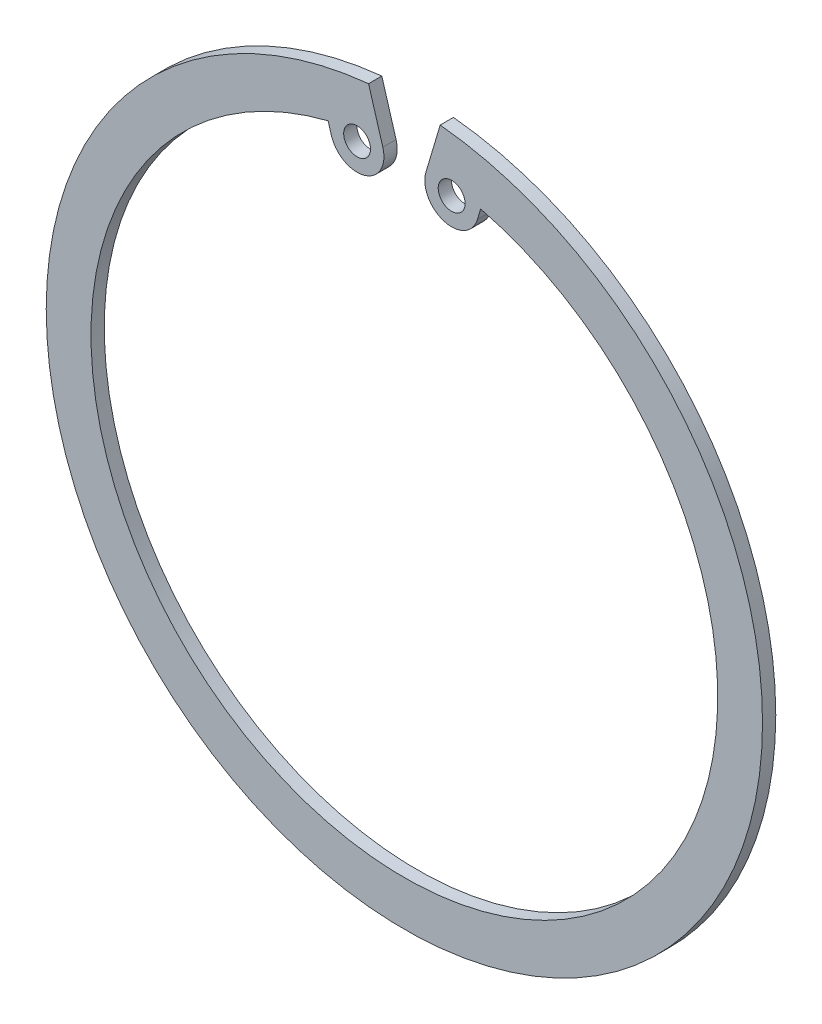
from build123d import *

# Parameters (mm, degrees)
SKETCH1_R          = 1.5
BASE_EXTRUDE_DEPTH = 1.48


with BuildPart() as part:
    # Sketch1 → Base-Extrude (new body)
    with BuildSketch(Plane.XY):
        with BuildLine():
            Line((2.405169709, 34.443622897), (4, 39.799497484))
            ThreePointArc((4, 39.799497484), (0, -40), (-4, 39.799497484))
            Line((-4, 39.799497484), (-2.405169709, 34.443622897))
            ThreePointArc((-2.405169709, 34.443622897), (-4.424240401, 30.712221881), (-8.155641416, 32.731292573))
            Line((-8.155641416, 32.731292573), (-8.517852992, 33.947697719))
            ThreePointArc((-8.517852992, 33.947697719), (0, -35), (8.517852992, 33.947697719))
            Line((8.517852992, 33.947697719), (8.155641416, 32.731292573))
            ThreePointArc((8.155641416, 32.731292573), (4.424240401, 30.712221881), (2.405169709, 34.443622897))
        make_face()
        with Locations((5.280405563, 33.587457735)):
            Circle(SKETCH1_R, mode=Mode.SUBTRACT)
        with Locations((-5.280405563, 33.587457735)):
            Circle(SKETCH1_R, mode=Mode.SUBTRACT)
    extrude(amount=BASE_EXTRUDE_DEPTH)


solid = part.part
